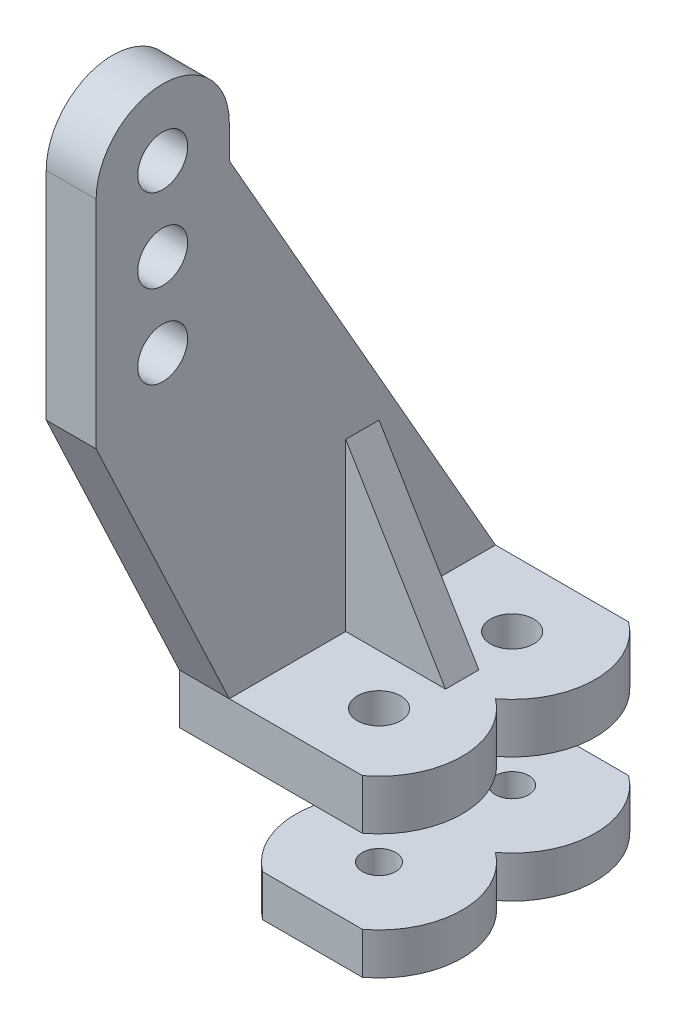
from build123d import *

# Parameters (mm, degrees)
SKETCH1_R      = 1.5
EXTRUDE1_DEPTH = 1.5
SKETCH2_R      = 1.3
EXTRUDE2_DEPTH = 3
EXTRUDE3_DEPTH = 1
EXTRUDE4_START = -2.5
SKETCH5_R      = 1
EXTRUDE4_DEPTH = 2.5


with BuildPart() as part:
    # Sketch1 → Extrude1 (new, symmetric)
    with BuildSketch(Plane(origin=(0, 0, 0), x_dir=(0, 0, -1), z_dir=(1, 0, 0))):
        with BuildLine():
            Line((4, 33.5), (4, 35.5))
            ThreePointArc((4, 35.5), (0, 39.5), (-4, 35.5))
            Line((-4, 35.5), (-4, 22.5))
            Line((-4, 22.5), (4, 5.5))
            Line((4, 5.5), (4, 2.5))
            Line((4, 2.5), (20, 2.5))
            Line((20, 2.5), (20, 5.5))
            Line((20, 5.5), (4, 33.5))
        make_face()
        with Locations((0, 35.5)):
            Circle(SKETCH1_R, mode=Mode.SUBTRACT)
        with Locations((0, 30.5)):
            Circle(SKETCH1_R, mode=Mode.SUBTRACT)
        with Locations((0, 25.5)):
            Circle(SKETCH1_R, mode=Mode.SUBTRACT)
    extrude(amount=EXTRUDE1_DEPTH, both=True)

    # Sketch2 → Extrude2 (add)
    with BuildSketch(Plane.XZ.offset(-2.5)):
        with BuildLine():
            Line((-1.5, -4), (9.5, -4))
            ThreePointArc((9.5, -4), (11.5, -8), (9.5, -12))
            ThreePointArc((9.5, -12), (11.5, -16), (9.5, -20))
            Line((9.5, -20), (-1.5, -20))
            Line((-1.5, -20), (-1.5, -4))
        make_face()
        with Locations(Location((6.5, -16, 0), (0, 0, 270))):
            Circle(SKETCH2_R, mode=Mode.SUBTRACT)
        with Locations(Location((6.5, -8, 0), (0, 0, 270))):
            Circle(SKETCH2_R, mode=Mode.SUBTRACT)
    extrude(amount=-EXTRUDE2_DEPTH)

    # Sketch4 → Extrude3 (add, symmetric)
    with BuildSketch(Plane.XY.offset(-12)):
        Polygon((1.5, 5.5), (1.5, 15.5), (7.5, 5.5), align=None)
    extrude(amount=EXTRUDE3_DEPTH, both=True)


with BuildPart() as body_2:
    # Sketch5 → Extrude4 (new body)
    with BuildSketch(Plane(origin=(0, -2.5, 0), x_dir=(-1, 0, 0), z_dir=(0, 1, 0)).offset(EXTRUDE4_START)):
        with BuildLine():
            Line((-9.5, -4), (-3.5, -4))
            ThreePointArc((-3.5, -4), (-1.5, -8), (-3.5, -12))
            ThreePointArc((-3.5, -12), (-1.5, -16), (-3.5, -20))
            Line((-3.5, -20), (-9.5, -20))
            ThreePointArc((-9.5, -20), (-11.5, -16), (-9.5, -12))
            ThreePointArc((-9.5, -12), (-11.5, -8), (-9.5, -4))
        make_face()
        with Locations(Location((-6.5, -8, 0), (0, 0, 90))):
            Circle(SKETCH5_R, mode=Mode.SUBTRACT)
        with Locations(Location((-6.5, -16, 0), (0, 0, 90))):
            Circle(SKETCH5_R, mode=Mode.SUBTRACT)
    extrude(amount=EXTRUDE4_DEPTH)

    # Sketch7 → Revolve1 (revolve)
    with BuildSketch(Plane(origin=(6.5, 0, 0), x_dir=(0, 0, -1), z_dir=(1, 0, 0)), mode=Mode.PRIVATE) as revolve1_sk:
        Polygon((9, -5), (10, -5), (9.25, -7.5), (9, -7.5), align=None)
    revolve(revolve1_sk.sketch.rotate(Axis((6.5, -2.5, -8), (0, -1, 0)), 180), axis=Axis((6.5, -2.5, -8), (0, -1, 0)))

    # Sketch8 → Revolve2 (revolve)
    with BuildSketch(Plane(origin=(6.5, 0, 0), x_dir=(0, 0, -1), z_dir=(1, 0, 0)), mode=Mode.PRIVATE) as revolve2_sk:
        Polygon((17, -5), (18, -5), (17.25, -7.5), (17, -7.5), align=None)
    revolve(revolve2_sk.sketch.rotate(Axis((6.5, -2.5, -16), (0, -1, 0)), 180), axis=Axis((6.5, -2.5, -16), (0, -1, 0)))


solid = Compound([part.part, body_2.part])
